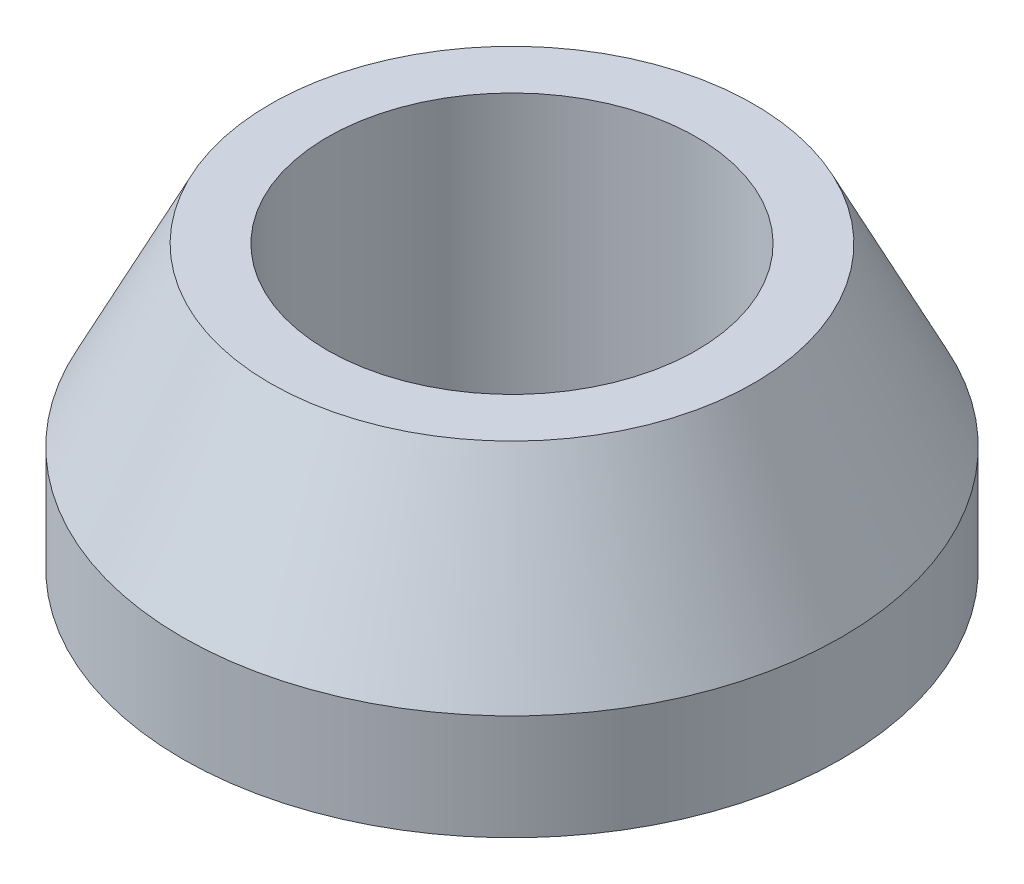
ISO-10303-21;
HEADER;
FILE_DESCRIPTION(('STEP AP214'),'2;1');
FILE_NAME('part.step','',(''),(''),'','','');
FILE_SCHEMA(('AUTOMOTIVE_DESIGN { 1 0 10303 214 1 1 1 1 }'));
ENDSEC;
DATA;
#1=APPLICATION_CONTEXT('core data for automotive mechanical design processes');
#2=APPLICATION_PROTOCOL_DEFINITION('international standard','automotive_design',2000,#1);
#3=PRODUCT_CONTEXT('',#1,'mechanical');
#4=PRODUCT('Part','Part','',(#3));
#5=PRODUCT_RELATED_PRODUCT_CATEGORY('part','',(#4));
#6=PRODUCT_DEFINITION_FORMATION('','',#4);
#7=PRODUCT_DEFINITION_CONTEXT('part definition',#1,'design');
#8=PRODUCT_DEFINITION('design','',#6,#7);
#9=PRODUCT_DEFINITION_SHAPE('','',#8);
#10=(LENGTH_UNIT() NAMED_UNIT(*) SI_UNIT(.MILLI.,.METRE.));
#11=(NAMED_UNIT(*) PLANE_ANGLE_UNIT() SI_UNIT($,.RADIAN.));
#12=(NAMED_UNIT(*) SI_UNIT($,.STERADIAN.) SOLID_ANGLE_UNIT());
#13=UNCERTAINTY_MEASURE_WITH_UNIT(LENGTH_MEASURE(1.E-05),#10,'distance_accuracy_value','');
#14=(GEOMETRIC_REPRESENTATION_CONTEXT(3) GLOBAL_UNCERTAINTY_ASSIGNED_CONTEXT((#13)) GLOBAL_UNIT_ASSIGNED_CONTEXT((#10,
#11,#12)) REPRESENTATION_CONTEXT('',''));
#15=CARTESIAN_POINT('',(0.,0.,0.));
#16=DIRECTION('',(0.,0.,1.));
#17=DIRECTION('',(1.,0.,0.));
#18=AXIS2_PLACEMENT_3D('',#15,#16,#17);
#19=CARTESIAN_POINT('',(0.,3.2,0.));
#20=DIRECTION('',(0.,1.,0.));
#21=DIRECTION('',(0.,0.,1.));
#22=AXIS2_PLACEMENT_3D('',#19,#20,#21);
#23=PLANE('',#22);
#24=CARTESIAN_POINT('',(0.,3.2,0.));
#25=DIRECTION('',(0.,1.,0.));
#26=DIRECTION('',(0.,0.,1.));
#27=AXIS2_PLACEMENT_3D('',#24,#25,#26);
#28=CIRCLE('',#27,2.75);
#29=CARTESIAN_POINT('',(0.,3.2,2.75));
#30=VERTEX_POINT('',#29);
#31=EDGE_CURVE('E49',#30,#30,#28,.T.);
#32=ORIENTED_EDGE('',*,*,#31,.T.);
#33=EDGE_LOOP('',(#32));
#34=FACE_BOUND('',#33,.T.);
#35=CARTESIAN_POINT('',(0.,3.2,0.));
#36=DIRECTION('',(0.,1.,0.));
#37=DIRECTION('',(0.,0.,1.));
#38=AXIS2_PLACEMENT_3D('',#35,#36,#37);
#39=CIRCLE('',#38,2.1);
#40=CARTESIAN_POINT('',(0.,3.2,2.1));
#41=VERTEX_POINT('',#40);
#42=EDGE_CURVE('E57',#41,#41,#39,.T.);
#43=ORIENTED_EDGE('',*,*,#42,.F.);
#44=EDGE_LOOP('',(#43));
#45=FACE_BOUND('',#44,.T.);
#46=ADVANCED_FACE('F41',(#34,#45),#23,.T.);
#47=CARTESIAN_POINT('',(0.,0.,0.));
#48=DIRECTION('',(0.,1.,0.));
#49=DIRECTION('',(0.,0.,1.));
#50=AXIS2_PLACEMENT_3D('',#47,#48,#49);
#51=PLANE('',#50);
#52=CARTESIAN_POINT('',(0.,0.,0.));
#53=DIRECTION('',(0.,1.,0.));
#54=DIRECTION('',(0.,0.,1.));
#55=AXIS2_PLACEMENT_3D('',#52,#53,#54);
#56=CIRCLE('',#55,3.75);
#57=CARTESIAN_POINT('',(0.,0.,3.75));
#58=VERTEX_POINT('',#57);
#59=EDGE_CURVE('E53',#58,#58,#56,.T.);
#60=ORIENTED_EDGE('',*,*,#59,.F.);
#61=EDGE_LOOP('',(#60));
#62=FACE_BOUND('',#61,.T.);
#63=CARTESIAN_POINT('',(0.,0.,0.));
#64=DIRECTION('',(0.,1.,0.));
#65=DIRECTION('',(0.,0.,1.));
#66=AXIS2_PLACEMENT_3D('',#63,#64,#65);
#67=CIRCLE('',#66,2.1);
#68=CARTESIAN_POINT('',(0.,0.,2.1));
#69=VERTEX_POINT('',#68);
#70=EDGE_CURVE('E60',#69,#69,#67,.T.);
#71=ORIENTED_EDGE('',*,*,#70,.T.);
#72=EDGE_LOOP('',(#71));
#73=FACE_BOUND('',#72,.T.);
#74=ADVANCED_FACE('F70',(#62,#73),#51,.F.);
#75=CARTESIAN_POINT('',(0.,3.2,0.));
#76=DIRECTION('',(0.,-1.,0.));
#77=DIRECTION('',(0.,0.,-1.));
#78=AXIS2_PLACEMENT_3D('',#75,#76,#77);
#79=CYLINDRICAL_SURFACE('',#78,3.75);
#80=CARTESIAN_POINT('',(0.,1.19999999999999,0.));
#81=DIRECTION('',(0.,1.,0.));
#82=DIRECTION('',(0.,0.,1.));
#83=AXIS2_PLACEMENT_3D('',#80,#81,#82);
#84=CIRCLE('',#83,3.75);
#85=CARTESIAN_POINT('',(0.,1.19999999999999,3.75));
#86=VERTEX_POINT('',#85);
#87=EDGE_CURVE('E10',#86,#86,#84,.F.);
#88=ORIENTED_EDGE('',*,*,#87,.T.);
#89=EDGE_LOOP('',(#88));
#90=FACE_BOUND('',#89,.T.);
#91=ORIENTED_EDGE('',*,*,#59,.T.);
#92=EDGE_LOOP('',(#91));
#93=FACE_BOUND('',#92,.T.);
#94=ADVANCED_FACE('F77',(#90,#93),#79,.T.);
#95=CARTESIAN_POINT('',(0.,3.2,0.));
#96=DIRECTION('',(0.,-1.,0.));
#97=DIRECTION('',(0.,0.,-1.));
#98=AXIS2_PLACEMENT_3D('',#95,#96,#97);
#99=CYLINDRICAL_SURFACE('',#98,2.1);
#100=ORIENTED_EDGE('',*,*,#42,.T.);
#101=EDGE_LOOP('',(#100));
#102=FACE_BOUND('',#101,.T.);
#103=ORIENTED_EDGE('',*,*,#70,.F.);
#104=EDGE_LOOP('',(#103));
#105=FACE_BOUND('',#104,.T.);
#106=ADVANCED_FACE('F66',(#102,#105),#99,.F.);
#107=CARTESIAN_POINT('',(0.,3.2,0.));
#108=DIRECTION('',(0.,-1.,0.));
#109=DIRECTION('',(0.,0.,-1.));
#110=AXIS2_PLACEMENT_3D('',#107,#108,#109);
#111=CONICAL_SURFACE('',#110,2.75,0.463647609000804);
#112=ORIENTED_EDGE('',*,*,#87,.F.);
#113=EDGE_LOOP('',(#112));
#114=FACE_BOUND('',#113,.T.);
#115=ORIENTED_EDGE('',*,*,#31,.F.);
#116=EDGE_LOOP('',(#115));
#117=FACE_BOUND('',#116,.T.);
#118=ADVANCED_FACE('F44',(#114,#117),#111,.T.);
#119=CLOSED_SHELL('',(#46,#74,#94,#106,#118));
#120=MANIFOLD_SOLID_BREP('B2',#119);
#121=ADVANCED_BREP_SHAPE_REPRESENTATION('',(#18,#120),#14);
#122=SHAPE_DEFINITION_REPRESENTATION(#9,#121);
ENDSEC;
END-ISO-10303-21;
